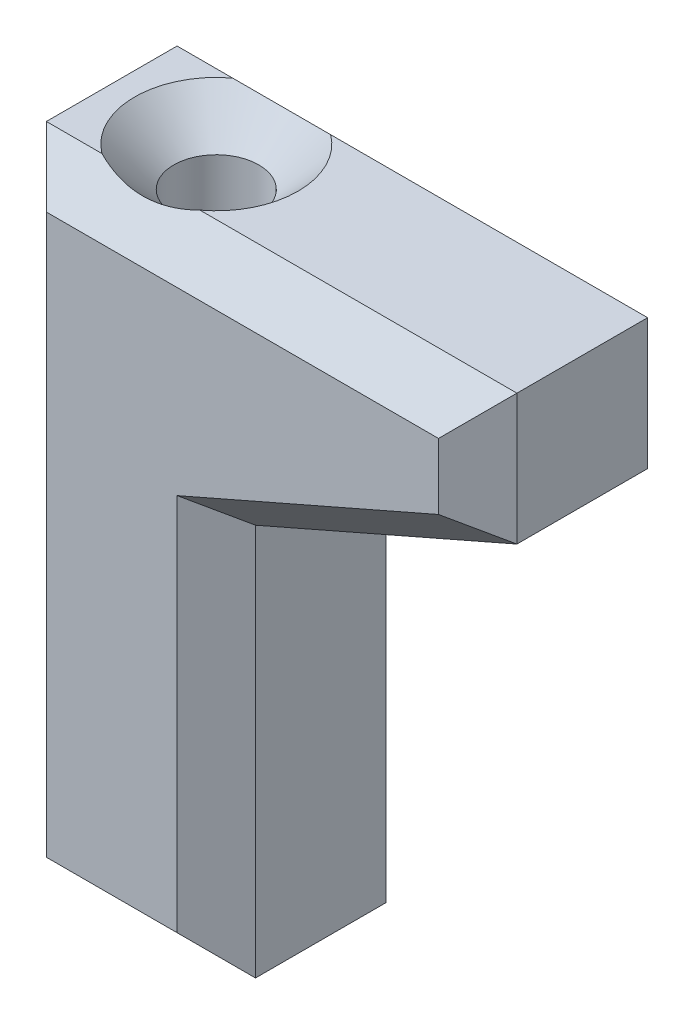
ISO-10303-21;
HEADER;
FILE_DESCRIPTION(('STEP AP214'),'2;1');
FILE_NAME('part.step','',(''),(''),'','','');
FILE_SCHEMA(('AUTOMOTIVE_DESIGN { 1 0 10303 214 1 1 1 1 }'));
ENDSEC;
DATA;
#1=APPLICATION_CONTEXT('core data for automotive mechanical design processes');
#2=APPLICATION_PROTOCOL_DEFINITION('international standard','automotive_design',2000,#1);
#3=PRODUCT_CONTEXT('',#1,'mechanical');
#4=PRODUCT('Part','Part','',(#3));
#5=PRODUCT_RELATED_PRODUCT_CATEGORY('part','',(#4));
#6=PRODUCT_DEFINITION_FORMATION('','',#4);
#7=PRODUCT_DEFINITION_CONTEXT('part definition',#1,'design');
#8=PRODUCT_DEFINITION('design','',#6,#7);
#9=PRODUCT_DEFINITION_SHAPE('','',#8);
#10=(LENGTH_UNIT() NAMED_UNIT(*) SI_UNIT(.MILLI.,.METRE.));
#11=(NAMED_UNIT(*) PLANE_ANGLE_UNIT() SI_UNIT($,.RADIAN.));
#12=(NAMED_UNIT(*) SI_UNIT($,.STERADIAN.) SOLID_ANGLE_UNIT());
#13=UNCERTAINTY_MEASURE_WITH_UNIT(LENGTH_MEASURE(1.E-05),#10,'distance_accuracy_value','');
#14=(GEOMETRIC_REPRESENTATION_CONTEXT(3) GLOBAL_UNCERTAINTY_ASSIGNED_CONTEXT((#13)) GLOBAL_UNIT_ASSIGNED_CONTEXT((#10,
#11,#12)) REPRESENTATION_CONTEXT('',''));
#15=CARTESIAN_POINT('',(0.,0.,0.));
#16=DIRECTION('',(0.,0.,1.));
#17=DIRECTION('',(1.,0.,0.));
#18=AXIS2_PLACEMENT_3D('',#15,#16,#17);
#19=CARTESIAN_POINT('',(-8.,48.75,8.));
#20=DIRECTION('',(0.,-1.,0.));
#21=DIRECTION('',(0.,0.,-1.));
#22=AXIS2_PLACEMENT_3D('',#19,#20,#21);
#23=PLANE('',#22);
#24=CARTESIAN_POINT('',(0.,48.75,0.));
#25=DIRECTION('',(0.,-1.,0.));
#26=DIRECTION('',(0.,0.,-1.));
#27=AXIS2_PLACEMENT_3D('',#24,#25,#26);
#28=CIRCLE('',#27,6.24999999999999);
#29=CARTESIAN_POINT('',(-3.75,48.75,4.99999999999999));
#30=VERTEX_POINT('',#29);
#31=CARTESIAN_POINT('',(-3.74999999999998,48.75,-5.00000000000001));
#32=VERTEX_POINT('',#31);
#33=EDGE_CURVE('E257',#30,#32,#28,.T.);
#34=ORIENTED_EDGE('',*,*,#33,.T.);
#35=DIRECTION('',(-1.,0.,0.));
#36=VECTOR('',#35,1.);
#37=CARTESIAN_POINT('',(-8.,48.75,-5.00000000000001));
#38=LINE('',#37,#36);
#39=CARTESIAN_POINT('',(-8.,48.75,-5.00000000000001));
#40=VERTEX_POINT('',#39);
#41=EDGE_CURVE('E323',#32,#40,#38,.T.);
#42=ORIENTED_EDGE('',*,*,#41,.T.);
#43=DIRECTION('',(0.,0.,-1.));
#44=VECTOR('',#43,1.);
#45=CARTESIAN_POINT('',(-8.,48.75,8.));
#46=LINE('',#45,#44);
#47=CARTESIAN_POINT('',(-8.,48.75,4.99999999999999));
#48=VERTEX_POINT('',#47);
#49=EDGE_CURVE('E244',#48,#40,#46,.T.);
#50=ORIENTED_EDGE('',*,*,#49,.F.);
#51=DIRECTION('',(1.,0.,0.));
#52=VECTOR('',#51,1.);
#53=CARTESIAN_POINT('',(-8.,48.75,4.99999999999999));
#54=LINE('',#53,#52);
#55=EDGE_CURVE('E321',#48,#30,#54,.T.);
#56=ORIENTED_EDGE('',*,*,#55,.T.);
#57=EDGE_LOOP('',(#34,#42,#50,#56));
#58=FACE_BOUND('',#57,.T.);
#59=ADVANCED_FACE('F33',(#58),#23,.F.);
#60=CARTESIAN_POINT('',(8.,30.,8.));
#61=DIRECTION('',(-1.,0.,0.));
#62=DIRECTION('',(0.,-1.,0.));
#63=AXIS2_PLACEMENT_3D('',#60,#61,#62);
#64=PLANE('',#63);
#65=DIRECTION('',(0.,0.,-1.));
#66=VECTOR('',#65,1.);
#67=CARTESIAN_POINT('',(8.,0.,8.));
#68=LINE('',#67,#66);
#69=CARTESIAN_POINT('',(8.,0.,4.99999999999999));
#70=VERTEX_POINT('',#69);
#71=CARTESIAN_POINT('',(8.,0.,-5.00000000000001));
#72=VERTEX_POINT('',#71);
#73=EDGE_CURVE('E359',#70,#72,#68,.T.);
#74=ORIENTED_EDGE('',*,*,#73,.T.);
#75=DIRECTION('',(0.,1.,0.));
#76=VECTOR('',#75,1.);
#77=CARTESIAN_POINT('',(8.,30.,-5.00000000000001));
#78=LINE('',#77,#76);
#79=CARTESIAN_POINT('',(8.,30.,-5.00000000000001));
#80=VERTEX_POINT('',#79);
#81=EDGE_CURVE('E334',#72,#80,#78,.T.);
#82=ORIENTED_EDGE('',*,*,#81,.T.);
#83=DIRECTION('',(0.,0.,-1.));
#84=VECTOR('',#83,1.);
#85=CARTESIAN_POINT('',(8.,30.,8.));
#86=LINE('',#85,#84);
#87=CARTESIAN_POINT('',(8.,30.,4.99999999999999));
#88=VERTEX_POINT('',#87);
#89=EDGE_CURVE('E161',#88,#80,#86,.T.);
#90=ORIENTED_EDGE('',*,*,#89,.F.);
#91=DIRECTION('',(0.,-1.,0.));
#92=VECTOR('',#91,1.);
#93=CARTESIAN_POINT('',(8.,30.,4.99999999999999));
#94=LINE('',#93,#92);
#95=EDGE_CURVE('E332',#88,#70,#94,.T.);
#96=ORIENTED_EDGE('',*,*,#95,.T.);
#97=EDGE_LOOP('',(#74,#82,#90,#96));
#98=FACE_BOUND('',#97,.T.);
#99=ADVANCED_FACE('F219',(#98),#64,.F.);
#100=CARTESIAN_POINT('',(28.,38.75,8.));
#101=DIRECTION('',(-0.400818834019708,0.916157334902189,0.));
#102=DIRECTION('',(-0.916157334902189,-0.400818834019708,0.));
#103=AXIS2_PLACEMENT_3D('',#100,#101,#102);
#104=PLANE('',#103);
#105=ORIENTED_EDGE('',*,*,#89,.T.);
#106=DIRECTION('',(0.916157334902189,0.400818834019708,0.));
#107=VECTOR('',#106,1.);
#108=CARTESIAN_POINT('',(28.,38.75,-5.00000000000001));
#109=LINE('',#108,#107);
#110=CARTESIAN_POINT('',(28.,38.75,-5.00000000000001));
#111=VERTEX_POINT('',#110);
#112=EDGE_CURVE('E160',#80,#111,#109,.T.);
#113=ORIENTED_EDGE('',*,*,#112,.T.);
#114=DIRECTION('',(0.,0.,-1.));
#115=VECTOR('',#114,1.);
#116=CARTESIAN_POINT('',(28.,38.75,8.));
#117=LINE('',#116,#115);
#118=CARTESIAN_POINT('',(28.,38.75,4.99999999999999));
#119=VERTEX_POINT('',#118);
#120=EDGE_CURVE('E142',#119,#111,#117,.T.);
#121=ORIENTED_EDGE('',*,*,#120,.F.);
#122=DIRECTION('',(-0.916157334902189,-0.400818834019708,0.));
#123=VECTOR('',#122,1.);
#124=CARTESIAN_POINT('',(28.,38.75,4.99999999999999));
#125=LINE('',#124,#123);
#126=EDGE_CURVE('E157',#119,#88,#125,.T.);
#127=ORIENTED_EDGE('',*,*,#126,.T.);
#128=EDGE_LOOP('',(#105,#113,#121,#127));
#129=FACE_BOUND('',#128,.T.);
#130=ADVANCED_FACE('F156',(#129),#104,.F.);
#131=CARTESIAN_POINT('',(28.,48.75,8.));
#132=DIRECTION('',(-1.,0.,0.));
#133=DIRECTION('',(0.,-1.,0.));
#134=AXIS2_PLACEMENT_3D('',#131,#132,#133);
#135=PLANE('',#134);
#136=ORIENTED_EDGE('',*,*,#120,.T.);
#137=DIRECTION('',(0.,1.,0.));
#138=VECTOR('',#137,1.);
#139=CARTESIAN_POINT('',(28.,48.75,-5.00000000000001));
#140=LINE('',#139,#138);
#141=CARTESIAN_POINT('',(28.,48.75,-5.00000000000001));
#142=VERTEX_POINT('',#141);
#143=EDGE_CURVE('E149',#111,#142,#140,.T.);
#144=ORIENTED_EDGE('',*,*,#143,.T.);
#145=DIRECTION('',(0.,0.,-1.));
#146=VECTOR('',#145,1.);
#147=CARTESIAN_POINT('',(28.,48.75,8.));
#148=LINE('',#147,#146);
#149=CARTESIAN_POINT('',(28.,48.75,4.99999999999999));
#150=VERTEX_POINT('',#149);
#151=EDGE_CURVE('E144',#150,#142,#148,.T.);
#152=ORIENTED_EDGE('',*,*,#151,.F.);
#153=DIRECTION('',(0.,-1.,0.));
#154=VECTOR('',#153,1.);
#155=CARTESIAN_POINT('',(28.,48.75,4.99999999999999));
#156=LINE('',#155,#154);
#157=EDGE_CURVE('E139',#150,#119,#156,.T.);
#158=ORIENTED_EDGE('',*,*,#157,.T.);
#159=EDGE_LOOP('',(#136,#144,#152,#158));
#160=FACE_BOUND('',#159,.T.);
#161=ADVANCED_FACE('F141',(#160),#135,.F.);
#162=ORIENTED_EDGE('',*,*,#151,.T.);
#163=DIRECTION('',(-1.,0.,0.));
#164=VECTOR('',#163,1.);
#165=CARTESIAN_POINT('',(-8.,48.75,-5.00000000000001));
#166=LINE('',#165,#164);
#167=CARTESIAN_POINT('',(3.74999999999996,48.75,-5.00000000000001));
#168=VERTEX_POINT('',#167);
#169=EDGE_CURVE('E240',#142,#168,#166,.T.);
#170=ORIENTED_EDGE('',*,*,#169,.T.);
#171=CARTESIAN_POINT('',(0.,48.75,0.));
#172=DIRECTION('',(0.,-1.,0.));
#173=DIRECTION('',(0.,0.,-1.));
#174=AXIS2_PLACEMENT_3D('',#171,#172,#173);
#175=CIRCLE('',#174,6.24999999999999);
#176=CARTESIAN_POINT('',(6.24999999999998,48.75,0.));
#177=VERTEX_POINT('',#176);
#178=EDGE_CURVE('E317',#168,#177,#175,.T.);
#179=ORIENTED_EDGE('',*,*,#178,.T.);
#180=CARTESIAN_POINT('',(0.,48.75,0.));
#181=DIRECTION('',(0.,-1.,0.));
#182=DIRECTION('',(0.,0.,-1.));
#183=AXIS2_PLACEMENT_3D('',#180,#181,#182);
#184=CIRCLE('',#183,6.24999999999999);
#185=CARTESIAN_POINT('',(3.74999999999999,48.75,4.99999999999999));
#186=VERTEX_POINT('',#185);
#187=EDGE_CURVE('E315',#177,#186,#184,.T.);
#188=ORIENTED_EDGE('',*,*,#187,.T.);
#189=DIRECTION('',(1.,0.,0.));
#190=VECTOR('',#189,1.);
#191=CARTESIAN_POINT('',(-8.,48.75,4.99999999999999));
#192=LINE('',#191,#190);
#193=EDGE_CURVE('E243',#186,#150,#192,.T.);
#194=ORIENTED_EDGE('',*,*,#193,.T.);
#195=EDGE_LOOP('',(#162,#170,#179,#188,#194));
#196=FACE_BOUND('',#195,.T.);
#197=ADVANCED_FACE('F222',(#196),#23,.F.);
#198=CARTESIAN_POINT('',(-8.,0.,8.));
#199=DIRECTION('',(1.,0.,0.));
#200=DIRECTION('',(0.,0.,-1.));
#201=AXIS2_PLACEMENT_3D('',#198,#199,#200);
#202=PLANE('',#201);
#203=ORIENTED_EDGE('',*,*,#49,.T.);
#204=DIRECTION('',(0.,-1.,0.));
#205=VECTOR('',#204,1.);
#206=CARTESIAN_POINT('',(-8.,0.,-5.00000000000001));
#207=LINE('',#206,#205);
#208=CARTESIAN_POINT('',(-8.,0.,-5.00000000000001));
#209=VERTEX_POINT('',#208);
#210=EDGE_CURVE('E303',#40,#209,#207,.T.);
#211=ORIENTED_EDGE('',*,*,#210,.T.);
#212=DIRECTION('',(0.,0.,-1.));
#213=VECTOR('',#212,1.);
#214=CARTESIAN_POINT('',(-8.,0.,8.));
#215=LINE('',#214,#213);
#216=CARTESIAN_POINT('',(-8.,0.,4.99999999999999));
#217=VERTEX_POINT('',#216);
#218=EDGE_CURVE('E365',#217,#209,#215,.T.);
#219=ORIENTED_EDGE('',*,*,#218,.F.);
#220=DIRECTION('',(0.,1.,0.));
#221=VECTOR('',#220,1.);
#222=CARTESIAN_POINT('',(-8.,0.,4.99999999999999));
#223=LINE('',#222,#221);
#224=EDGE_CURVE('E325',#217,#48,#223,.T.);
#225=ORIENTED_EDGE('',*,*,#224,.T.);
#226=EDGE_LOOP('',(#203,#211,#219,#225));
#227=FACE_BOUND('',#226,.T.);
#228=ADVANCED_FACE('F231',(#227),#202,.F.);
#229=CARTESIAN_POINT('',(8.,0.,8.));
#230=DIRECTION('',(0.,1.,0.));
#231=DIRECTION('',(-1.,0.,0.));
#232=AXIS2_PLACEMENT_3D('',#229,#230,#231);
#233=PLANE('',#232);
#234=CARTESIAN_POINT('',(0.,0.,0.));
#235=DIRECTION('',(0.,-1.,0.));
#236=DIRECTION('',(1.,0.,0.));
#237=AXIS2_PLACEMENT_3D('',#234,#235,#236);
#238=CIRCLE('',#237,3.25);
#239=CARTESIAN_POINT('',(3.25,0.,0.));
#240=VERTEX_POINT('',#239);
#241=EDGE_CURVE('E369',#240,#240,#238,.T.);
#242=ORIENTED_EDGE('',*,*,#241,.F.);
#243=EDGE_LOOP('',(#242));
#244=FACE_BOUND('',#243,.T.);
#245=ORIENTED_EDGE('',*,*,#218,.T.);
#246=DIRECTION('',(1.,0.,0.));
#247=VECTOR('',#246,1.);
#248=CARTESIAN_POINT('',(8.,0.,-5.00000000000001));
#249=LINE('',#248,#247);
#250=EDGE_CURVE('E330',#209,#72,#249,.T.);
#251=ORIENTED_EDGE('',*,*,#250,.T.);
#252=ORIENTED_EDGE('',*,*,#73,.F.);
#253=DIRECTION('',(-1.,0.,0.));
#254=VECTOR('',#253,1.);
#255=CARTESIAN_POINT('',(8.,0.,4.99999999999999));
#256=LINE('',#255,#254);
#257=EDGE_CURVE('E328',#70,#217,#256,.T.);
#258=ORIENTED_EDGE('',*,*,#257,.T.);
#259=EDGE_LOOP('',(#245,#251,#252,#258));
#260=FACE_BOUND('',#259,.T.);
#261=ADVANCED_FACE('F237',(#244,#260),#233,.F.);
#262=CARTESIAN_POINT('',(0.,0.,8.));
#263=DIRECTION('',(0.,0.,-1.));
#264=DIRECTION('',(-1.,0.,0.));
#265=AXIS2_PLACEMENT_3D('',#262,#263,#264);
#266=PLANE('',#265);
#267=DIRECTION('',(0.,-1.,0.));
#268=VECTOR('',#267,1.);
#269=CARTESIAN_POINT('',(-5.,0.,8.));
#270=LINE('',#269,#268);
#271=CARTESIAN_POINT('',(-5.,45.75,8.));
#272=VERTEX_POINT('',#271);
#273=CARTESIAN_POINT('',(-5.,3.,8.));
#274=VERTEX_POINT('',#273);
#275=EDGE_CURVE('E50',#272,#274,#270,.T.);
#276=ORIENTED_EDGE('',*,*,#275,.T.);
#277=DIRECTION('',(1.,0.,0.));
#278=VECTOR('',#277,1.);
#279=CARTESIAN_POINT('',(0.,3.,8.));
#280=LINE('',#279,#278);
#281=CARTESIAN_POINT('',(5.,3.,8.));
#282=VERTEX_POINT('',#281);
#283=EDGE_CURVE('E42',#274,#282,#280,.T.);
#284=ORIENTED_EDGE('',*,*,#283,.T.);
#285=DIRECTION('',(0.,1.,0.));
#286=VECTOR('',#285,1.);
#287=CARTESIAN_POINT('',(5.,0.,8.));
#288=LINE('',#287,#286);
#289=CARTESIAN_POINT('',(4.99999999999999,31.9620467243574,8.));
#290=VERTEX_POINT('',#289);
#291=EDGE_CURVE('E336',#282,#290,#288,.T.);
#292=ORIENTED_EDGE('',*,*,#291,.T.);
#293=DIRECTION('',(0.916157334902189,0.400818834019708,0.));
#294=VECTOR('',#293,1.);
#295=CARTESIAN_POINT('',(-10.9336040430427,24.9910949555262,8.));
#296=LINE('',#295,#294);
#297=CARTESIAN_POINT('',(25.,40.7120467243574,8.));
#298=VERTEX_POINT('',#297);
#299=EDGE_CURVE('E338',#290,#298,#296,.T.);
#300=ORIENTED_EDGE('',*,*,#299,.T.);
#301=DIRECTION('',(0.,1.,0.));
#302=VECTOR('',#301,1.);
#303=CARTESIAN_POINT('',(25.,0.,8.));
#304=LINE('',#303,#302);
#305=CARTESIAN_POINT('',(25.,45.75,8.));
#306=VERTEX_POINT('',#305);
#307=EDGE_CURVE('E173',#298,#306,#304,.T.);
#308=ORIENTED_EDGE('',*,*,#307,.T.);
#309=DIRECTION('',(-1.,0.,0.));
#310=VECTOR('',#309,1.);
#311=CARTESIAN_POINT('',(0.,45.75,8.));
#312=LINE('',#311,#310);
#313=EDGE_CURVE('E55',#306,#272,#312,.T.);
#314=ORIENTED_EDGE('',*,*,#313,.T.);
#315=EDGE_LOOP('',(#276,#284,#292,#300,#308,#314));
#316=FACE_BOUND('',#315,.T.);
#317=ADVANCED_FACE('F376',(#316),#266,.F.);
#318=CARTESIAN_POINT('',(0.,0.,-8.));
#319=DIRECTION('',(0.,0.,-1.));
#320=DIRECTION('',(-1.,0.,0.));
#321=AXIS2_PLACEMENT_3D('',#318,#319,#320);
#322=PLANE('',#321);
#323=DIRECTION('',(0.,-1.,0.));
#324=VECTOR('',#323,1.);
#325=CARTESIAN_POINT('',(25.,38.75,-8.));
#326=LINE('',#325,#324);
#327=CARTESIAN_POINT('',(25.,45.75,-8.));
#328=VERTEX_POINT('',#327);
#329=CARTESIAN_POINT('',(25.,40.7120467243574,-8.));
#330=VERTEX_POINT('',#329);
#331=EDGE_CURVE('E263',#328,#330,#326,.T.);
#332=ORIENTED_EDGE('',*,*,#331,.T.);
#333=DIRECTION('',(-0.916157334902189,-0.400818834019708,0.));
#334=VECTOR('',#333,1.);
#335=CARTESIAN_POINT('',(6.79754349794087,32.7484720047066,-8.));
#336=LINE('',#335,#334);
#337=CARTESIAN_POINT('',(4.99999999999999,31.9620467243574,-8.));
#338=VERTEX_POINT('',#337);
#339=EDGE_CURVE('E150',#330,#338,#336,.T.);
#340=ORIENTED_EDGE('',*,*,#339,.T.);
#341=DIRECTION('',(0.,-1.,0.));
#342=VECTOR('',#341,1.);
#343=CARTESIAN_POINT('',(5.,0.,-8.));
#344=LINE('',#343,#342);
#345=CARTESIAN_POINT('',(5.,3.,-8.));
#346=VERTEX_POINT('',#345);
#347=EDGE_CURVE('E349',#338,#346,#344,.T.);
#348=ORIENTED_EDGE('',*,*,#347,.T.);
#349=DIRECTION('',(-1.,0.,0.));
#350=VECTOR('',#349,1.);
#351=CARTESIAN_POINT('',(-8.,3.,-8.));
#352=LINE('',#351,#350);
#353=CARTESIAN_POINT('',(-5.,3.,-8.));
#354=VERTEX_POINT('',#353);
#355=EDGE_CURVE('E308',#346,#354,#352,.T.);
#356=ORIENTED_EDGE('',*,*,#355,.T.);
#357=DIRECTION('',(0.,1.,0.));
#358=VECTOR('',#357,1.);
#359=CARTESIAN_POINT('',(-5.,48.75,-8.));
#360=LINE('',#359,#358);
#361=CARTESIAN_POINT('',(-5.,45.75,-8.));
#362=VERTEX_POINT('',#361);
#363=EDGE_CURVE('E301',#354,#362,#360,.T.);
#364=ORIENTED_EDGE('',*,*,#363,.T.);
#365=DIRECTION('',(1.,0.,0.));
#366=VECTOR('',#365,1.);
#367=CARTESIAN_POINT('',(28.,45.75,-8.));
#368=LINE('',#367,#366);
#369=EDGE_CURVE('E304',#362,#328,#368,.T.);
#370=ORIENTED_EDGE('',*,*,#369,.T.);
#371=EDGE_LOOP('',(#332,#340,#348,#356,#364,#370));
#372=FACE_BOUND('',#371,.T.);
#373=ADVANCED_FACE('F348',(#372),#322,.T.);
#374=CARTESIAN_POINT('',(0.,48.75,0.));
#375=DIRECTION('',(0.,-1.,0.));
#376=DIRECTION('',(1.,0.,0.));
#377=AXIS2_PLACEMENT_3D('',#374,#375,#376);
#378=CYLINDRICAL_SURFACE('',#377,3.25);
#379=CARTESIAN_POINT('',(0.,45.75,0.));
#380=DIRECTION('',(0.,-1.,0.));
#381=DIRECTION('',(1.,0.,0.));
#382=AXIS2_PLACEMENT_3D('',#379,#380,#381);
#383=CIRCLE('',#382,3.25);
#384=CARTESIAN_POINT('',(3.24999999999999,45.75,0.));
#385=VERTEX_POINT('',#384);
#386=EDGE_CURVE('E11',#385,#385,#383,.F.);
#387=ORIENTED_EDGE('',*,*,#386,.T.);
#388=EDGE_LOOP('',(#387));
#389=FACE_BOUND('',#388,.T.);
#390=ORIENTED_EDGE('',*,*,#241,.T.);
#391=EDGE_LOOP('',(#390));
#392=FACE_BOUND('',#391,.T.);
#393=ADVANCED_FACE('F216',(#389,#392),#378,.F.);
#394=CARTESIAN_POINT('',(5.,0.,8.));
#395=DIRECTION('',(-0.707106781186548,0.,-0.707106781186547));
#396=DIRECTION('',(0.,1.,0.));
#397=AXIS2_PLACEMENT_3D('',#394,#395,#396);
#398=PLANE('',#397);
#399=DIRECTION('',(0.577350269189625,-0.577350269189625,-0.577350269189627));
#400=VECTOR('',#399,1.);
#401=CARTESIAN_POINT('',(6.,2.,7.));
#402=LINE('',#401,#400);
#403=EDGE_CURVE('E174',#70,#282,#402,.F.);
#404=ORIENTED_EDGE('',*,*,#403,.F.);
#405=ORIENTED_EDGE('',*,*,#95,.F.);
#406=DIRECTION('',(-0.641799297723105,0.419746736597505,0.641799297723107));
#407=VECTOR('',#406,1.);
#408=CARTESIAN_POINT('',(0.314774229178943,35.0262573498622,12.6852257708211));
#409=LINE('',#408,#407);
#410=EDGE_CURVE('E37',#290,#88,#409,.F.);
#411=ORIENTED_EDGE('',*,*,#410,.F.);
#412=ORIENTED_EDGE('',*,*,#291,.F.);
#413=EDGE_LOOP('',(#404,#405,#411,#412));
#414=FACE_BOUND('',#413,.T.);
#415=ADVANCED_FACE('F35',(#414),#398,.F.);
#416=CARTESIAN_POINT('',(-10.9336040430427,24.9910949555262,8.));
#417=DIRECTION('',(-0.283421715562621,0.647821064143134,-0.707106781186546));
#418=DIRECTION('',(0.916157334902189,0.400818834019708,0.));
#419=AXIS2_PLACEMENT_3D('',#416,#417,#418);
#420=PLANE('',#419);
#421=ORIENTED_EDGE('',*,*,#410,.T.);
#422=ORIENTED_EDGE('',*,*,#126,.F.);
#423=DIRECTION('',(-0.641799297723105,0.419746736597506,0.641799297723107));
#424=VECTOR('',#423,1.);
#425=CARTESIAN_POINT('',(14.4338376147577,47.6224814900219,18.5661623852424));
#426=LINE('',#425,#424);
#427=EDGE_CURVE('E168',#298,#119,#426,.F.);
#428=ORIENTED_EDGE('',*,*,#427,.F.);
#429=ORIENTED_EDGE('',*,*,#299,.F.);
#430=EDGE_LOOP('',(#421,#422,#428,#429));
#431=FACE_BOUND('',#430,.T.);
#432=ADVANCED_FACE('F166',(#431),#420,.F.);
#433=CARTESIAN_POINT('',(0.,3.,8.));
#434=DIRECTION('',(0.,0.707106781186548,-0.707106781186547));
#435=DIRECTION('',(1.,0.,0.));
#436=AXIS2_PLACEMENT_3D('',#433,#434,#435);
#437=PLANE('',#436);
#438=ORIENTED_EDGE('',*,*,#403,.T.);
#439=ORIENTED_EDGE('',*,*,#283,.F.);
#440=DIRECTION('',(0.577350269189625,0.577350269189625,0.577350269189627));
#441=VECTOR('',#440,1.);
#442=CARTESIAN_POINT('',(-6.,2.,7.));
#443=LINE('',#442,#441);
#444=EDGE_CURVE('E175',#217,#274,#443,.T.);
#445=ORIENTED_EDGE('',*,*,#444,.F.);
#446=ORIENTED_EDGE('',*,*,#257,.F.);
#447=EDGE_LOOP('',(#438,#439,#445,#446));
#448=FACE_BOUND('',#447,.T.);
#449=ADVANCED_FACE('F209',(#448),#437,.F.);
#450=CARTESIAN_POINT('',(25.,0.,8.));
#451=DIRECTION('',(-0.707106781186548,0.,-0.707106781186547));
#452=DIRECTION('',(0.,1.,0.));
#453=AXIS2_PLACEMENT_3D('',#450,#451,#452);
#454=PLANE('',#453);
#455=ORIENTED_EDGE('',*,*,#427,.T.);
#456=ORIENTED_EDGE('',*,*,#157,.F.);
#457=DIRECTION('',(-0.577350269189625,-0.577350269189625,0.577350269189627));
#458=VECTOR('',#457,1.);
#459=CARTESIAN_POINT('',(9.75000000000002,30.5,23.25));
#460=LINE('',#459,#458);
#461=EDGE_CURVE('E178',#306,#150,#460,.F.);
#462=ORIENTED_EDGE('',*,*,#461,.F.);
#463=ORIENTED_EDGE('',*,*,#307,.F.);
#464=EDGE_LOOP('',(#455,#456,#462,#463));
#465=FACE_BOUND('',#464,.T.);
#466=ADVANCED_FACE('F172',(#465),#454,.F.);
#467=CARTESIAN_POINT('',(-5.,0.,8.));
#468=DIRECTION('',(0.707106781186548,0.,-0.707106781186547));
#469=DIRECTION('',(0.,-1.,0.));
#470=AXIS2_PLACEMENT_3D('',#467,#468,#469);
#471=PLANE('',#470);
#472=ORIENTED_EDGE('',*,*,#444,.T.);
#473=ORIENTED_EDGE('',*,*,#275,.F.);
#474=DIRECTION('',(0.577350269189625,-0.577350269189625,0.577350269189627));
#475=VECTOR('',#474,1.);
#476=CARTESIAN_POINT('',(-3.33333333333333,44.0833333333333,9.66666666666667));
#477=LINE('',#476,#475);
#478=EDGE_CURVE('E182',#48,#272,#477,.T.);
#479=ORIENTED_EDGE('',*,*,#478,.F.);
#480=ORIENTED_EDGE('',*,*,#224,.F.);
#481=EDGE_LOOP('',(#472,#473,#479,#480));
#482=FACE_BOUND('',#481,.T.);
#483=ADVANCED_FACE('F202',(#482),#471,.F.);
#484=CARTESIAN_POINT('',(0.,45.75,8.));
#485=DIRECTION('',(0.,-0.707106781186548,-0.707106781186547));
#486=DIRECTION('',(-1.,0.,0.));
#487=AXIS2_PLACEMENT_3D('',#484,#485,#486);
#488=PLANE('',#487);
#489=ORIENTED_EDGE('',*,*,#461,.T.);
#490=ORIENTED_EDGE('',*,*,#193,.F.);
#491=CARTESIAN_POINT('',(-3.75059995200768,48.7502,4.99979999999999));
#492=CARTESIAN_POINT('',(-3.62810630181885,48.709362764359,5.040637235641));
#493=CARTESIAN_POINT('',(-3.50452854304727,48.670164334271,5.07983566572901));
#494=CARTESIAN_POINT('',(-3.25523857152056,48.5952679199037,5.15473208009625));
#495=CARTESIAN_POINT('',(-3.12952588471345,48.5595707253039,5.19042927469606));
#496=CARTESIAN_POINT('',(-2.7489862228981,48.4580029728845,5.29199702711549));
#497=CARTESIAN_POINT('',(-2.4910802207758,48.3977649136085,5.35223508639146));
#498=CARTESIAN_POINT('',(-1.96971846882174,48.2944289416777,5.45557105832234));
#499=CARTESIAN_POINT('',(-1.70629296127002,48.2512550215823,5.49874497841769));
#500=CARTESIAN_POINT('',(-1.17487802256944,48.18321489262,5.56678510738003));
#501=CARTESIAN_POINT('',(-0.906891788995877,48.1583363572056,5.59166364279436));
#502=CARTESIAN_POINT('',(-0.383796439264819,48.1286781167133,5.62132188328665));
#503=CARTESIAN_POINT('',(-0.12880588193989,48.1228516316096,5.62714836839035));
#504=CARTESIAN_POINT('',(0.380841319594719,48.1285599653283,5.62144003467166));
#505=CARTESIAN_POINT('',(0.635497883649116,48.1400983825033,5.60990161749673));
#506=CARTESIAN_POINT('',(1.14193872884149,48.1801078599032,5.56989214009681));
#507=CARTESIAN_POINT('',(1.39372479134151,48.2085677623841,5.54143223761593));
#508=CARTESIAN_POINT('',(1.89253392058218,48.2814210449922,5.4685789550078));
#509=CARTESIAN_POINT('',(2.13955835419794,48.3258097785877,5.42419022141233));
#510=CARTESIAN_POINT('',(2.61790316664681,48.4271535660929,5.32284643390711));
#511=CARTESIAN_POINT('',(2.84946108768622,48.4835547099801,5.26644529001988));
#512=CARTESIAN_POINT('',(3.30542936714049,48.6082825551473,5.14171744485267));
#513=CARTESIAN_POINT('',(3.52985585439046,48.6765796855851,5.07342031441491));
#514=CARTESIAN_POINT('',(3.75059995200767,48.7502,4.99979999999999));
#515=B_SPLINE_CURVE_WITH_KNOTS('',3,(#491,#492,#493,#494,#495,#496,#497,#498,#499,#500,#501,
#502,#503,#504,#505,#506,#507,#508,#509,#510,#511,#512,#513,#514),.UNSPECIFIED.,.F.,.F.,(4,2,2,
2,2,2,2,2,2,2,2,4),(0.,0.406230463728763,0.812552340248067,1.62626480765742,2.43631083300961,
3.24581058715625,4.01001273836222,4.77437326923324,5.53823035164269,6.30186479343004,
7.03589348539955,7.76812292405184),.UNSPECIFIED.);
#516=EDGE_CURVE('E185',#30,#186,#515,.T.);
#517=ORIENTED_EDGE('',*,*,#516,.F.);
#518=ORIENTED_EDGE('',*,*,#55,.F.);
#519=ORIENTED_EDGE('',*,*,#478,.T.);
#520=ORIENTED_EDGE('',*,*,#313,.F.);
#521=EDGE_LOOP('',(#489,#490,#517,#518,#519,#520));
#522=FACE_BOUND('',#521,.T.);
#523=ADVANCED_FACE('F197',(#522),#488,.F.);
#524=CARTESIAN_POINT('',(0.,48.75,0.));
#525=DIRECTION('',(0.,1.,0.));
#526=DIRECTION('',(-1.,0.,0.));
#527=AXIS2_PLACEMENT_3D('',#524,#525,#526);
#528=CONICAL_SURFACE('',#527,6.24999999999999,0.785398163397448);
#529=ORIENTED_EDGE('',*,*,#386,.F.);
#530=EDGE_LOOP('',(#529));
#531=FACE_BOUND('',#530,.T.);
#532=ORIENTED_EDGE('',*,*,#187,.F.);
#533=ORIENTED_EDGE('',*,*,#178,.F.);
#534=CARTESIAN_POINT('',(-3.75059995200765,48.7502,-4.99980000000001));
#535=CARTESIAN_POINT('',(-3.62810630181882,48.709362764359,-5.04063723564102));
#536=CARTESIAN_POINT('',(-3.50452854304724,48.670164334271,-5.07983566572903));
#537=CARTESIAN_POINT('',(-3.25523857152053,48.5952679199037,-5.15473208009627));
#538=CARTESIAN_POINT('',(-3.12952588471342,48.5595707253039,-5.19042927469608));
#539=CARTESIAN_POINT('',(-2.74898622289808,48.4580029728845,-5.29199702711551));
#540=CARTESIAN_POINT('',(-2.49108022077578,48.3977649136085,-5.35223508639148));
#541=CARTESIAN_POINT('',(-1.96971846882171,48.2944289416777,-5.45557105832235));
#542=CARTESIAN_POINT('',(-1.70629296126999,48.2512550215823,-5.49874497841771));
#543=CARTESIAN_POINT('',(-1.17487802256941,48.18321489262,-5.56678510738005));
#544=CARTESIAN_POINT('',(-0.906891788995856,48.1583363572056,-5.59166364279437));
#545=CARTESIAN_POINT('',(-0.383796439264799,48.1286781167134,-5.62132188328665));
#546=CARTESIAN_POINT('',(-0.12880588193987,48.1228516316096,-5.62714836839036));
#547=CARTESIAN_POINT('',(0.380841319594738,48.1285599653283,-5.62144003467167));
#548=CARTESIAN_POINT('',(0.635497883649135,48.1400983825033,-5.60990161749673));
#549=CARTESIAN_POINT('',(1.14193872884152,48.1801078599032,-5.56989214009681));
#550=CARTESIAN_POINT('',(1.39372479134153,48.2085677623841,-5.54143223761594));
#551=CARTESIAN_POINT('',(1.8925339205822,48.2814210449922,-5.4685789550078));
#552=CARTESIAN_POINT('',(2.13955835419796,48.3258097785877,-5.42419022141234));
#553=CARTESIAN_POINT('',(2.61790316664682,48.4271535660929,-5.32284643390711));
#554=CARTESIAN_POINT('',(2.84946108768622,48.4835547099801,-5.26644529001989));
#555=CARTESIAN_POINT('',(3.30542936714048,48.6082825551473,-5.14171744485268));
#556=CARTESIAN_POINT('',(3.52985585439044,48.6765796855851,-5.07342031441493));
#557=CARTESIAN_POINT('',(3.75059995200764,48.7502,-4.99980000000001));
#558=B_SPLINE_CURVE_WITH_KNOTS('',3,(#534,#535,#536,#537,#538,#539,#540,#541,#542,#543,#544,
#545,#546,#547,#548,#549,#550,#551,#552,#553,#554,#555,#556,#557),.UNSPECIFIED.,.F.,.F.,(4,2,2,
2,2,2,2,2,2,2,2,4),(0.,0.40623046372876,0.812552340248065,1.62626480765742,2.4363108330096,
3.24581058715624,4.01001273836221,4.77437326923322,5.53823035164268,6.30186479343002,
7.03589348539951,7.76812292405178),.UNSPECIFIED.);
#559=EDGE_CURVE('E256',#32,#168,#558,.T.);
#560=ORIENTED_EDGE('',*,*,#559,.F.);
#561=ORIENTED_EDGE('',*,*,#33,.F.);
#562=ORIENTED_EDGE('',*,*,#516,.T.);
#563=EDGE_LOOP('',(#532,#533,#560,#561,#562));
#564=FACE_BOUND('',#563,.T.);
#565=ADVANCED_FACE('F201',(#531,#564),#528,.F.);
#566=CARTESIAN_POINT('',(-8.,0.,-5.00000000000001));
#567=DIRECTION('',(-0.707106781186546,0.,-0.707106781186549));
#568=DIRECTION('',(0.,1.,0.));
#569=AXIS2_PLACEMENT_3D('',#566,#567,#568);
#570=PLANE('',#569);
#571=DIRECTION('',(0.577350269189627,-0.577350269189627,-0.577350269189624));
#572=VECTOR('',#571,1.);
#573=CARTESIAN_POINT('',(8.25000000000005,32.5,-21.25));
#574=LINE('',#573,#572);
#575=EDGE_CURVE('E268',#362,#40,#574,.F.);
#576=ORIENTED_EDGE('',*,*,#575,.F.);
#577=ORIENTED_EDGE('',*,*,#363,.F.);
#578=DIRECTION('',(0.577350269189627,0.577350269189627,-0.577350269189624));
#579=VECTOR('',#578,1.);
#580=CARTESIAN_POINT('',(-2.66666666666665,5.33333333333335,-10.3333333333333));
#581=LINE('',#580,#579);
#582=EDGE_CURVE('E193',#209,#354,#581,.T.);
#583=ORIENTED_EDGE('',*,*,#582,.F.);
#584=ORIENTED_EDGE('',*,*,#210,.F.);
#585=EDGE_LOOP('',(#576,#577,#583,#584));
#586=FACE_BOUND('',#585,.T.);
#587=ADVANCED_FACE('F285',(#586),#570,.T.);
#588=CARTESIAN_POINT('',(8.,0.,-5.00000000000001));
#589=DIRECTION('',(0.,-0.707106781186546,-0.707106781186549));
#590=DIRECTION('',(-1.,0.,0.));
#591=AXIS2_PLACEMENT_3D('',#588,#589,#590);
#592=PLANE('',#591);
#593=ORIENTED_EDGE('',*,*,#582,.T.);
#594=ORIENTED_EDGE('',*,*,#355,.F.);
#595=DIRECTION('',(-0.577350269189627,0.577350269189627,-0.577350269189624));
#596=VECTOR('',#595,1.);
#597=CARTESIAN_POINT('',(-2.00000000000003,10.,-15.));
#598=LINE('',#597,#596);
#599=EDGE_CURVE('E264',#72,#346,#598,.T.);
#600=ORIENTED_EDGE('',*,*,#599,.F.);
#601=ORIENTED_EDGE('',*,*,#250,.F.);
#602=EDGE_LOOP('',(#593,#594,#600,#601));
#603=FACE_BOUND('',#602,.T.);
#604=ADVANCED_FACE('F290',(#603),#592,.T.);
#605=CARTESIAN_POINT('',(-8.,48.75,-5.00000000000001));
#606=DIRECTION('',(0.,0.707106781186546,-0.707106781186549));
#607=DIRECTION('',(1.,0.,0.));
#608=AXIS2_PLACEMENT_3D('',#605,#606,#607);
#609=PLANE('',#608);
#610=ORIENTED_EDGE('',*,*,#559,.T.);
#611=ORIENTED_EDGE('',*,*,#169,.F.);
#612=DIRECTION('',(-0.577350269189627,-0.577350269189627,-0.577350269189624));
#613=VECTOR('',#612,1.);
#614=CARTESIAN_POINT('',(16.,36.75,-17.));
#615=LINE('',#614,#613);
#616=EDGE_CURVE('E252',#328,#142,#615,.F.);
#617=ORIENTED_EDGE('',*,*,#616,.F.);
#618=ORIENTED_EDGE('',*,*,#369,.F.);
#619=ORIENTED_EDGE('',*,*,#575,.T.);
#620=ORIENTED_EDGE('',*,*,#41,.F.);
#621=EDGE_LOOP('',(#610,#611,#617,#618,#619,#620));
#622=FACE_BOUND('',#621,.T.);
#623=ADVANCED_FACE('F250',(#622),#609,.T.);
#624=CARTESIAN_POINT('',(8.,30.,-5.00000000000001));
#625=DIRECTION('',(0.707106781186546,0.,-0.707106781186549));
#626=DIRECTION('',(0.,-1.,0.));
#627=AXIS2_PLACEMENT_3D('',#624,#625,#626);
#628=PLANE('',#627);
#629=ORIENTED_EDGE('',*,*,#599,.T.);
#630=ORIENTED_EDGE('',*,*,#347,.F.);
#631=DIRECTION('',(0.641799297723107,-0.419746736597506,0.641799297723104));
#632=VECTOR('',#631,1.);
#633=CARTESIAN_POINT('',(13.8809366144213,26.1537758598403,0.880936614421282));
#634=LINE('',#633,#632);
#635=EDGE_CURVE('E265',#80,#338,#634,.F.);
#636=ORIENTED_EDGE('',*,*,#635,.F.);
#637=ORIENTED_EDGE('',*,*,#81,.F.);
#638=EDGE_LOOP('',(#629,#630,#636,#637));
#639=FACE_BOUND('',#638,.T.);
#640=ADVANCED_FACE('F289',(#639),#628,.T.);
#641=CARTESIAN_POINT('',(28.,48.75,-5.00000000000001));
#642=DIRECTION('',(0.707106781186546,0.,-0.707106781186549));
#643=DIRECTION('',(0.,-1.,0.));
#644=AXIS2_PLACEMENT_3D('',#641,#642,#643);
#645=PLANE('',#644);
#646=ORIENTED_EDGE('',*,*,#616,.T.);
#647=ORIENTED_EDGE('',*,*,#143,.F.);
#648=DIRECTION('',(-0.641799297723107,0.419746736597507,-0.641799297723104));
#649=VECTOR('',#648,1.);
#650=CARTESIAN_POINT('',(25.3060683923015,40.5118732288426,-7.69393160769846));
#651=LINE('',#650,#649);
#652=EDGE_CURVE('E270',#330,#111,#651,.F.);
#653=ORIENTED_EDGE('',*,*,#652,.F.);
#654=ORIENTED_EDGE('',*,*,#331,.F.);
#655=EDGE_LOOP('',(#646,#647,#653,#654));
#656=FACE_BOUND('',#655,.T.);
#657=ADVANCED_FACE('F261',(#656),#645,.T.);
#658=CARTESIAN_POINT('',(28.,38.75,-5.00000000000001));
#659=DIRECTION('',(0.28342171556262,-0.647821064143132,-0.707106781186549));
#660=DIRECTION('',(-0.916157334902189,-0.400818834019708,0.));
#661=AXIS2_PLACEMENT_3D('',#658,#659,#660);
#662=PLANE('',#661);
#663=ORIENTED_EDGE('',*,*,#635,.T.);
#664=ORIENTED_EDGE('',*,*,#339,.F.);
#665=ORIENTED_EDGE('',*,*,#652,.T.);
#666=ORIENTED_EDGE('',*,*,#112,.F.);
#667=EDGE_LOOP('',(#663,#664,#665,#666));
#668=FACE_BOUND('',#667,.T.);
#669=ADVANCED_FACE('F345',(#668),#662,.T.);
#670=CLOSED_SHELL('',(#59,#99,#130,#161,#197,#228,#261,#317,#373,#393,#415,#432,#449,#466,#483,
#523,#565,#587,#604,#623,#640,#657,#669));
#671=MANIFOLD_SOLID_BREP('B2',#670);
#672=ADVANCED_BREP_SHAPE_REPRESENTATION('',(#18,#671),#14);
#673=SHAPE_DEFINITION_REPRESENTATION(#9,#672);
ENDSEC;
END-ISO-10303-21;
